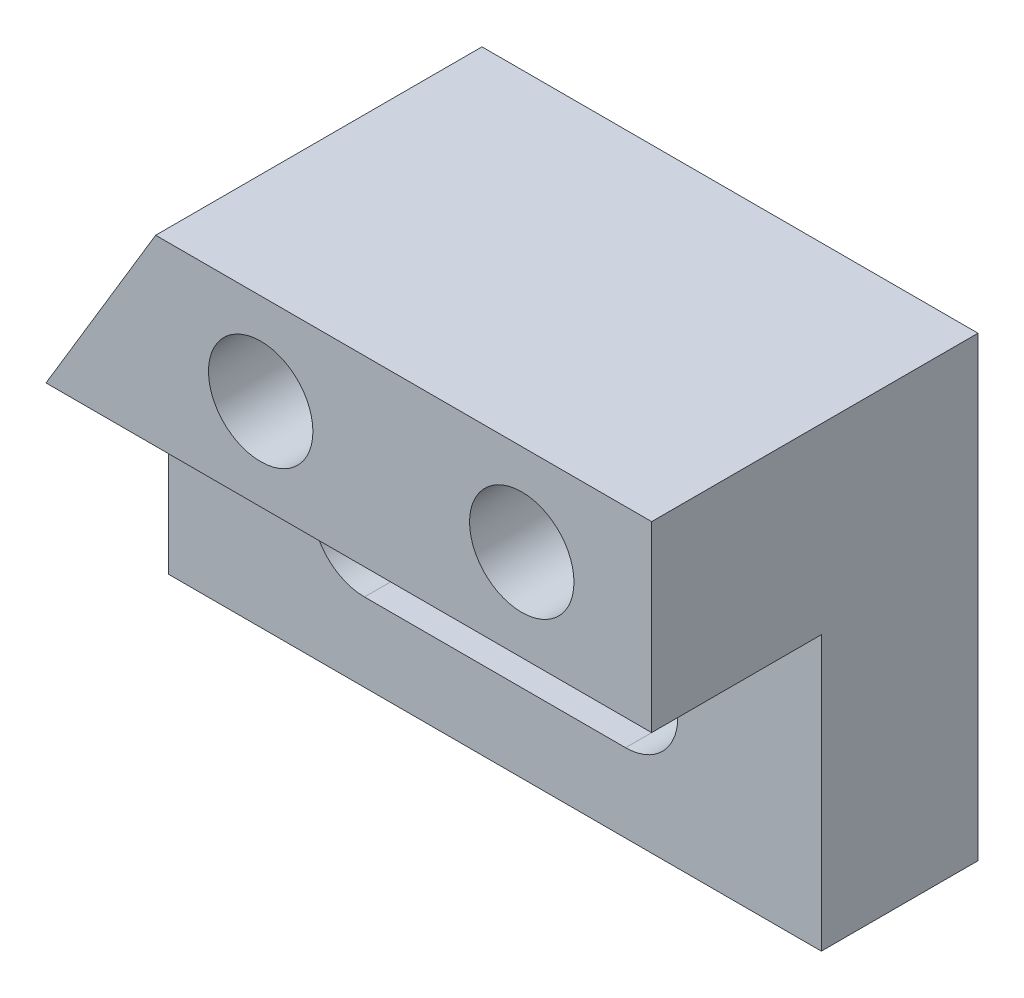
ISO-10303-21;
HEADER;
FILE_DESCRIPTION(('STEP AP214'),'2;1');
FILE_NAME('part.step','',(''),(''),'','','');
FILE_SCHEMA(('AUTOMOTIVE_DESIGN { 1 0 10303 214 1 1 1 1 }'));
ENDSEC;
DATA;
#1=APPLICATION_CONTEXT('core data for automotive mechanical design processes');
#2=APPLICATION_PROTOCOL_DEFINITION('international standard','automotive_design',2000,#1);
#3=PRODUCT_CONTEXT('',#1,'mechanical');
#4=PRODUCT('Part','Part','',(#3));
#5=PRODUCT_RELATED_PRODUCT_CATEGORY('part','',(#4));
#6=PRODUCT_DEFINITION_FORMATION('','',#4);
#7=PRODUCT_DEFINITION_CONTEXT('part definition',#1,'design');
#8=PRODUCT_DEFINITION('design','',#6,#7);
#9=PRODUCT_DEFINITION_SHAPE('','',#8);
#10=(LENGTH_UNIT() NAMED_UNIT(*) SI_UNIT(.MILLI.,.METRE.));
#11=(NAMED_UNIT(*) PLANE_ANGLE_UNIT() SI_UNIT($,.RADIAN.));
#12=(NAMED_UNIT(*) SI_UNIT($,.STERADIAN.) SOLID_ANGLE_UNIT());
#13=UNCERTAINTY_MEASURE_WITH_UNIT(LENGTH_MEASURE(1.E-05),#10,'distance_accuracy_value','');
#14=(GEOMETRIC_REPRESENTATION_CONTEXT(3) GLOBAL_UNCERTAINTY_ASSIGNED_CONTEXT((#13)) GLOBAL_UNIT_ASSIGNED_CONTEXT((#10,
#11,#12)) REPRESENTATION_CONTEXT('',''));
#15=CARTESIAN_POINT('',(0.,0.,0.));
#16=DIRECTION('',(0.,0.,1.));
#17=DIRECTION('',(1.,0.,0.));
#18=AXIS2_PLACEMENT_3D('',#15,#16,#17);
#19=CARTESIAN_POINT('',(0.,15.,12.));
#20=DIRECTION('',(1.,0.,0.));
#21=DIRECTION('',(0.,0.,-1.));
#22=AXIS2_PLACEMENT_3D('',#19,#20,#21);
#23=PLANE('',#22);
#24=DIRECTION('',(0.,-1.,0.));
#25=VECTOR('',#24,1.);
#26=CARTESIAN_POINT('',(0.,15.,0.));
#27=LINE('',#26,#25);
#28=CARTESIAN_POINT('',(0.,15.,0.));
#29=VERTEX_POINT('',#28);
#30=CARTESIAN_POINT('',(0.,0.,0.));
#31=VERTEX_POINT('',#30);
#32=EDGE_CURVE('E215',#29,#31,#27,.T.);
#33=ORIENTED_EDGE('',*,*,#32,.T.);
#34=DIRECTION('',(0.,0.,-1.));
#35=VECTOR('',#34,1.);
#36=CARTESIAN_POINT('',(0.,0.,12.));
#37=LINE('',#36,#35);
#38=CARTESIAN_POINT('',(0.,0.,12.));
#39=VERTEX_POINT('',#38);
#40=EDGE_CURVE('E11',#39,#31,#37,.T.);
#41=ORIENTED_EDGE('',*,*,#40,.F.);
#42=DIRECTION('',(0.,-1.,0.));
#43=VECTOR('',#42,1.);
#44=CARTESIAN_POINT('',(0.,15.,12.));
#45=LINE('',#44,#43);
#46=CARTESIAN_POINT('',(0.,15.,12.));
#47=VERTEX_POINT('',#46);
#48=EDGE_CURVE('E216',#47,#39,#45,.T.);
#49=ORIENTED_EDGE('',*,*,#48,.F.);
#50=DIRECTION('',(0.,0.,-1.));
#51=VECTOR('',#50,1.);
#52=CARTESIAN_POINT('',(0.,15.,12.));
#53=LINE('',#52,#51);
#54=EDGE_CURVE('E230',#47,#29,#53,.T.);
#55=ORIENTED_EDGE('',*,*,#54,.T.);
#56=EDGE_LOOP('',(#33,#41,#49,#55));
#57=FACE_BOUND('',#56,.T.);
#58=ADVANCED_FACE('F45',(#57),#23,.F.);
#59=CARTESIAN_POINT('',(0.,0.,12.));
#60=DIRECTION('',(0.,1.,0.));
#61=DIRECTION('',(0.,0.,1.));
#62=AXIS2_PLACEMENT_3D('',#59,#60,#61);
#63=PLANE('',#62);
#64=DIRECTION('',(1.,0.,0.));
#65=VECTOR('',#64,1.);
#66=CARTESIAN_POINT('',(0.,0.,0.));
#67=LINE('',#66,#65);
#68=CARTESIAN_POINT('',(50.,0.,0.));
#69=VERTEX_POINT('',#68);
#70=EDGE_CURVE('E234',#31,#69,#67,.T.);
#71=ORIENTED_EDGE('',*,*,#70,.T.);
#72=DIRECTION('',(0.,0.,-1.));
#73=VECTOR('',#72,1.);
#74=CARTESIAN_POINT('',(50.,0.,12.));
#75=LINE('',#74,#73);
#76=CARTESIAN_POINT('',(50.,0.,12.));
#77=VERTEX_POINT('',#76);
#78=EDGE_CURVE('E54',#77,#69,#75,.T.);
#79=ORIENTED_EDGE('',*,*,#78,.F.);
#80=DIRECTION('',(1.,0.,0.));
#81=VECTOR('',#80,1.);
#82=CARTESIAN_POINT('',(0.,0.,12.));
#83=LINE('',#82,#81);
#84=EDGE_CURVE('E220',#39,#77,#83,.T.);
#85=ORIENTED_EDGE('',*,*,#84,.F.);
#86=ORIENTED_EDGE('',*,*,#40,.T.);
#87=EDGE_LOOP('',(#71,#79,#85,#86));
#88=FACE_BOUND('',#87,.T.);
#89=ADVANCED_FACE('F285',(#88),#63,.F.);
#90=CARTESIAN_POINT('',(50.,35.,12.));
#91=DIRECTION('',(-1.,0.,0.));
#92=DIRECTION('',(0.,0.,1.));
#93=AXIS2_PLACEMENT_3D('',#90,#91,#92);
#94=PLANE('',#93);
#95=DIRECTION('',(0.,1.,0.));
#96=VECTOR('',#95,1.);
#97=CARTESIAN_POINT('',(50.,35.,0.));
#98=LINE('',#97,#96);
#99=CARTESIAN_POINT('',(50.,35.,0.));
#100=VERTEX_POINT('',#99);
#101=EDGE_CURVE('E238',#69,#100,#98,.T.);
#102=ORIENTED_EDGE('',*,*,#101,.T.);
#103=DIRECTION('',(0.,0.,-1.));
#104=VECTOR('',#103,1.);
#105=CARTESIAN_POINT('',(50.,35.,12.));
#106=LINE('',#105,#104);
#107=CARTESIAN_POINT('',(50.,35.,25.));
#108=VERTEX_POINT('',#107);
#109=EDGE_CURVE('E253',#108,#100,#106,.T.);
#110=ORIENTED_EDGE('',*,*,#109,.F.);
#111=DIRECTION('',(0.,-1.,0.));
#112=VECTOR('',#111,1.);
#113=CARTESIAN_POINT('',(50.,35.,25.));
#114=LINE('',#113,#112);
#115=CARTESIAN_POINT('',(50.,21.,25.));
#116=VERTEX_POINT('',#115);
#117=EDGE_CURVE('E191',#108,#116,#114,.T.);
#118=ORIENTED_EDGE('',*,*,#117,.T.);
#119=DIRECTION('',(0.,0.,-1.));
#120=VECTOR('',#119,1.);
#121=CARTESIAN_POINT('',(50.,21.,25.));
#122=LINE('',#121,#120);
#123=CARTESIAN_POINT('',(50.,21.,12.));
#124=VERTEX_POINT('',#123);
#125=EDGE_CURVE('E203',#116,#124,#122,.T.);
#126=ORIENTED_EDGE('',*,*,#125,.T.);
#127=DIRECTION('',(0.,1.,0.));
#128=VECTOR('',#127,1.);
#129=CARTESIAN_POINT('',(50.,0.,12.));
#130=LINE('',#129,#128);
#131=EDGE_CURVE('E224',#77,#124,#130,.T.);
#132=ORIENTED_EDGE('',*,*,#131,.F.);
#133=ORIENTED_EDGE('',*,*,#78,.T.);
#134=EDGE_LOOP('',(#102,#110,#118,#126,#132,#133));
#135=FACE_BOUND('',#134,.T.);
#136=ADVANCED_FACE('F290',(#135),#94,.F.);
#137=CARTESIAN_POINT('',(12.,35.,12.));
#138=DIRECTION('',(0.,-1.,0.));
#139=DIRECTION('',(0.,0.,-1.));
#140=AXIS2_PLACEMENT_3D('',#137,#138,#139);
#141=PLANE('',#140);
#142=DIRECTION('',(-1.,0.,0.));
#143=VECTOR('',#142,1.);
#144=CARTESIAN_POINT('',(12.,35.,0.));
#145=LINE('',#144,#143);
#146=CARTESIAN_POINT('',(12.,35.,0.));
#147=VERTEX_POINT('',#146);
#148=EDGE_CURVE('E241',#100,#147,#145,.T.);
#149=ORIENTED_EDGE('',*,*,#148,.T.);
#150=DIRECTION('',(0.,0.,-1.));
#151=VECTOR('',#150,1.);
#152=CARTESIAN_POINT('',(12.,35.,12.));
#153=LINE('',#152,#151);
#154=CARTESIAN_POINT('',(12.,35.,25.));
#155=VERTEX_POINT('',#154);
#156=EDGE_CURVE('E249',#155,#147,#153,.T.);
#157=ORIENTED_EDGE('',*,*,#156,.F.);
#158=DIRECTION('',(1.,0.,0.));
#159=VECTOR('',#158,1.);
#160=CARTESIAN_POINT('',(12.,35.,25.));
#161=LINE('',#160,#159);
#162=EDGE_CURVE('E187',#155,#108,#161,.T.);
#163=ORIENTED_EDGE('',*,*,#162,.T.);
#164=ORIENTED_EDGE('',*,*,#109,.T.);
#165=EDGE_LOOP('',(#149,#157,#163,#164));
#166=FACE_BOUND('',#165,.T.);
#167=ADVANCED_FACE('F309',(#166),#141,.F.);
#168=CARTESIAN_POINT('',(12.,35.,12.));
#169=DIRECTION('',(0.857492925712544,-0.514495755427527,0.));
#170=DIRECTION('',(0.514495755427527,0.857492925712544,0.));
#171=AXIS2_PLACEMENT_3D('',#168,#169,#170);
#172=PLANE('',#171);
#173=DIRECTION('',(-0.514495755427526,-0.857492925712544,0.));
#174=VECTOR('',#173,1.);
#175=CARTESIAN_POINT('',(12.,35.,12.));
#176=LINE('',#175,#174);
#177=CARTESIAN_POINT('',(3.6,21.,12.));
#178=VERTEX_POINT('',#177);
#179=EDGE_CURVE('E227',#178,#47,#176,.T.);
#180=ORIENTED_EDGE('',*,*,#179,.F.);
#181=DIRECTION('',(0.,0.,-1.));
#182=VECTOR('',#181,1.);
#183=CARTESIAN_POINT('',(3.6,21.,25.));
#184=LINE('',#183,#182);
#185=CARTESIAN_POINT('',(3.6,21.,25.));
#186=VERTEX_POINT('',#185);
#187=EDGE_CURVE('E204',#186,#178,#184,.T.);
#188=ORIENTED_EDGE('',*,*,#187,.F.);
#189=DIRECTION('',(0.514495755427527,0.857492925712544,0.));
#190=VECTOR('',#189,1.);
#191=CARTESIAN_POINT('',(3.6,21.,25.));
#192=LINE('',#191,#190);
#193=EDGE_CURVE('E199',#186,#155,#192,.T.);
#194=ORIENTED_EDGE('',*,*,#193,.T.);
#195=ORIENTED_EDGE('',*,*,#156,.T.);
#196=DIRECTION('',(-0.514495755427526,-0.857492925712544,0.));
#197=VECTOR('',#196,1.);
#198=CARTESIAN_POINT('',(12.,35.,0.));
#199=LINE('',#198,#197);
#200=EDGE_CURVE('E221',#147,#29,#199,.T.);
#201=ORIENTED_EDGE('',*,*,#200,.T.);
#202=ORIENTED_EDGE('',*,*,#54,.F.);
#203=EDGE_LOOP('',(#180,#188,#194,#195,#201,#202));
#204=FACE_BOUND('',#203,.T.);
#205=ADVANCED_FACE('F305',(#204),#172,.F.);
#206=CARTESIAN_POINT('',(0.,0.,12.));
#207=DIRECTION('',(0.,0.,1.));
#208=DIRECTION('',(1.,0.,0.));
#209=AXIS2_PLACEMENT_3D('',#206,#207,#208);
#210=PLANE('',#209);
#211=CARTESIAN_POINT('',(35.,10.,12.));
#212=DIRECTION('',(0.,0.,1.));
#213=DIRECTION('',(1.,0.,0.));
#214=AXIS2_PLACEMENT_3D('',#211,#212,#213);
#215=CIRCLE('',#214,4.);
#216=CARTESIAN_POINT('',(35.,6.,12.));
#217=VERTEX_POINT('',#216);
#218=CARTESIAN_POINT('',(35.,14.,12.));
#219=VERTEX_POINT('',#218);
#220=EDGE_CURVE('E62',#217,#219,#215,.T.);
#221=ORIENTED_EDGE('',*,*,#220,.F.);
#222=DIRECTION('',(1.,0.,0.));
#223=VECTOR('',#222,1.);
#224=CARTESIAN_POINT('',(35.,6.,12.));
#225=LINE('',#224,#223);
#226=CARTESIAN_POINT('',(15.,5.99999999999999,12.));
#227=VERTEX_POINT('',#226);
#228=EDGE_CURVE('E151',#227,#217,#225,.T.);
#229=ORIENTED_EDGE('',*,*,#228,.F.);
#230=CARTESIAN_POINT('',(15.,10.,12.));
#231=DIRECTION('',(0.,0.,1.));
#232=DIRECTION('',(-1.,0.,0.));
#233=AXIS2_PLACEMENT_3D('',#230,#231,#232);
#234=CIRCLE('',#233,4.);
#235=CARTESIAN_POINT('',(15.,14.,12.));
#236=VERTEX_POINT('',#235);
#237=EDGE_CURVE('E155',#236,#227,#234,.T.);
#238=ORIENTED_EDGE('',*,*,#237,.F.);
#239=DIRECTION('',(-1.,0.,0.));
#240=VECTOR('',#239,1.);
#241=CARTESIAN_POINT('',(15.,14.,12.));
#242=LINE('',#241,#240);
#243=EDGE_CURVE('E164',#219,#236,#242,.T.);
#244=ORIENTED_EDGE('',*,*,#243,.F.);
#245=EDGE_LOOP('',(#221,#229,#238,#244));
#246=FACE_BOUND('',#245,.T.);
#247=DIRECTION('',(1.,0.,0.));
#248=VECTOR('',#247,1.);
#249=CARTESIAN_POINT('',(0.,21.,12.));
#250=LINE('',#249,#248);
#251=EDGE_CURVE('E208',#178,#124,#250,.T.);
#252=ORIENTED_EDGE('',*,*,#251,.F.);
#253=ORIENTED_EDGE('',*,*,#179,.T.);
#254=ORIENTED_EDGE('',*,*,#48,.T.);
#255=ORIENTED_EDGE('',*,*,#84,.T.);
#256=ORIENTED_EDGE('',*,*,#131,.T.);
#257=EDGE_LOOP('',(#252,#253,#254,#255,#256));
#258=FACE_BOUND('',#257,.T.);
#259=ADVANCED_FACE('F302',(#246,#258),#210,.T.);
#260=CARTESIAN_POINT('',(0.,0.,0.));
#261=DIRECTION('',(0.,0.,1.));
#262=DIRECTION('',(1.,0.,0.));
#263=AXIS2_PLACEMENT_3D('',#260,#261,#262);
#264=PLANE('',#263);
#265=DIRECTION('',(1.,0.,0.));
#266=VECTOR('',#265,1.);
#267=CARTESIAN_POINT('',(35.,6.,0.));
#268=LINE('',#267,#266);
#269=CARTESIAN_POINT('',(15.,5.99999999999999,0.));
#270=VERTEX_POINT('',#269);
#271=CARTESIAN_POINT('',(35.,6.,0.));
#272=VERTEX_POINT('',#271);
#273=EDGE_CURVE('E139',#270,#272,#268,.T.);
#274=ORIENTED_EDGE('',*,*,#273,.T.);
#275=CARTESIAN_POINT('',(35.,10.,0.));
#276=DIRECTION('',(0.,0.,1.));
#277=DIRECTION('',(1.,0.,0.));
#278=AXIS2_PLACEMENT_3D('',#275,#276,#277);
#279=CIRCLE('',#278,4.);
#280=CARTESIAN_POINT('',(35.,14.,0.));
#281=VERTEX_POINT('',#280);
#282=EDGE_CURVE('E132',#272,#281,#279,.T.);
#283=ORIENTED_EDGE('',*,*,#282,.T.);
#284=DIRECTION('',(-1.,0.,0.));
#285=VECTOR('',#284,1.);
#286=CARTESIAN_POINT('',(15.,14.,0.));
#287=LINE('',#286,#285);
#288=CARTESIAN_POINT('',(15.,14.,0.));
#289=VERTEX_POINT('',#288);
#290=EDGE_CURVE('E142',#281,#289,#287,.T.);
#291=ORIENTED_EDGE('',*,*,#290,.T.);
#292=CARTESIAN_POINT('',(15.,10.,0.));
#293=DIRECTION('',(0.,0.,1.));
#294=DIRECTION('',(-1.,0.,0.));
#295=AXIS2_PLACEMENT_3D('',#292,#293,#294);
#296=CIRCLE('',#295,4.);
#297=EDGE_CURVE('E70',#289,#270,#296,.T.);
#298=ORIENTED_EDGE('',*,*,#297,.T.);
#299=EDGE_LOOP('',(#274,#283,#291,#298));
#300=FACE_BOUND('',#299,.T.);
#301=CARTESIAN_POINT('',(20.0469106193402,28.,0.));
#302=DIRECTION('',(0.,0.,1.));
#303=DIRECTION('',(1.,0.,0.));
#304=AXIS2_PLACEMENT_3D('',#301,#302,#303);
#305=CIRCLE('',#304,4.);
#306=CARTESIAN_POINT('',(24.0469106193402,28.,0.));
#307=VERTEX_POINT('',#306);
#308=EDGE_CURVE('E179',#307,#307,#305,.T.);
#309=ORIENTED_EDGE('',*,*,#308,.T.);
#310=EDGE_LOOP('',(#309));
#311=FACE_BOUND('',#310,.T.);
#312=CARTESIAN_POINT('',(40.0469106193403,28.,0.));
#313=DIRECTION('',(0.,0.,1.));
#314=DIRECTION('',(1.,0.,0.));
#315=AXIS2_PLACEMENT_3D('',#312,#313,#314);
#316=CIRCLE('',#315,4.);
#317=CARTESIAN_POINT('',(44.0469106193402,28.,0.));
#318=VERTEX_POINT('',#317);
#319=EDGE_CURVE('E173',#318,#318,#316,.T.);
#320=ORIENTED_EDGE('',*,*,#319,.T.);
#321=EDGE_LOOP('',(#320));
#322=FACE_BOUND('',#321,.T.);
#323=ORIENTED_EDGE('',*,*,#32,.F.);
#324=ORIENTED_EDGE('',*,*,#200,.F.);
#325=ORIENTED_EDGE('',*,*,#148,.F.);
#326=ORIENTED_EDGE('',*,*,#101,.F.);
#327=ORIENTED_EDGE('',*,*,#70,.F.);
#328=EDGE_LOOP('',(#323,#324,#325,#326,#327));
#329=FACE_BOUND('',#328,.T.);
#330=ADVANCED_FACE('F147',(#300,#311,#322,#329),#264,.F.);
#331=CARTESIAN_POINT('',(50.,21.,25.));
#332=DIRECTION('',(0.,-1.,0.));
#333=DIRECTION('',(0.,0.,-1.));
#334=AXIS2_PLACEMENT_3D('',#331,#332,#333);
#335=PLANE('',#334);
#336=ORIENTED_EDGE('',*,*,#187,.T.);
#337=ORIENTED_EDGE('',*,*,#251,.T.);
#338=ORIENTED_EDGE('',*,*,#125,.F.);
#339=DIRECTION('',(-1.,0.,0.));
#340=VECTOR('',#339,1.);
#341=CARTESIAN_POINT('',(50.,21.,25.));
#342=LINE('',#341,#340);
#343=EDGE_CURVE('E195',#116,#186,#342,.T.);
#344=ORIENTED_EDGE('',*,*,#343,.T.);
#345=EDGE_LOOP('',(#336,#337,#338,#344));
#346=FACE_BOUND('',#345,.T.);
#347=ADVANCED_FACE('F315',(#346),#335,.T.);
#348=CARTESIAN_POINT('',(0.,0.,25.));
#349=DIRECTION('',(0.,0.,-1.));
#350=DIRECTION('',(-1.,0.,0.));
#351=AXIS2_PLACEMENT_3D('',#348,#349,#350);
#352=PLANE('',#351);
#353=CARTESIAN_POINT('',(20.0469106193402,28.,25.));
#354=DIRECTION('',(0.,0.,-1.));
#355=DIRECTION('',(-1.,0.,0.));
#356=AXIS2_PLACEMENT_3D('',#353,#354,#355);
#357=CIRCLE('',#356,4.);
#358=CARTESIAN_POINT('',(16.0469106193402,28.,25.));
#359=VERTEX_POINT('',#358);
#360=EDGE_CURVE('E48',#359,#359,#357,.T.);
#361=ORIENTED_EDGE('',*,*,#360,.T.);
#362=EDGE_LOOP('',(#361));
#363=FACE_BOUND('',#362,.T.);
#364=CARTESIAN_POINT('',(40.0469106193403,28.,25.));
#365=DIRECTION('',(0.,0.,-1.));
#366=DIRECTION('',(-1.,0.,0.));
#367=AXIS2_PLACEMENT_3D('',#364,#365,#366);
#368=CIRCLE('',#367,4.);
#369=CARTESIAN_POINT('',(36.0469106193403,28.,25.));
#370=VERTEX_POINT('',#369);
#371=EDGE_CURVE('E183',#370,#370,#368,.T.);
#372=ORIENTED_EDGE('',*,*,#371,.T.);
#373=EDGE_LOOP('',(#372));
#374=FACE_BOUND('',#373,.T.);
#375=ORIENTED_EDGE('',*,*,#162,.F.);
#376=ORIENTED_EDGE('',*,*,#193,.F.);
#377=ORIENTED_EDGE('',*,*,#343,.F.);
#378=ORIENTED_EDGE('',*,*,#117,.F.);
#379=EDGE_LOOP('',(#375,#376,#377,#378));
#380=FACE_BOUND('',#379,.T.);
#381=ADVANCED_FACE('F267',(#363,#374,#380),#352,.F.);
#382=CARTESIAN_POINT('',(40.0469106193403,28.,0.));
#383=DIRECTION('',(0.,0.,1.));
#384=DIRECTION('',(1.,0.,0.));
#385=AXIS2_PLACEMENT_3D('',#382,#383,#384);
#386=CYLINDRICAL_SURFACE('',#385,4.);
#387=ORIENTED_EDGE('',*,*,#319,.F.);
#388=EDGE_LOOP('',(#387));
#389=FACE_BOUND('',#388,.T.);
#390=ORIENTED_EDGE('',*,*,#371,.F.);
#391=EDGE_LOOP('',(#390));
#392=FACE_BOUND('',#391,.T.);
#393=ADVANCED_FACE('F271',(#389,#392),#386,.F.);
#394=CARTESIAN_POINT('',(20.0469106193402,28.,0.));
#395=DIRECTION('',(0.,0.,1.));
#396=DIRECTION('',(1.,0.,0.));
#397=AXIS2_PLACEMENT_3D('',#394,#395,#396);
#398=CYLINDRICAL_SURFACE('',#397,4.);
#399=ORIENTED_EDGE('',*,*,#308,.F.);
#400=EDGE_LOOP('',(#399));
#401=FACE_BOUND('',#400,.T.);
#402=ORIENTED_EDGE('',*,*,#360,.F.);
#403=EDGE_LOOP('',(#402));
#404=FACE_BOUND('',#403,.T.);
#405=ADVANCED_FACE('F269',(#401,#404),#398,.F.);
#406=CARTESIAN_POINT('',(35.,10.,0.));
#407=DIRECTION('',(0.,0.,1.));
#408=DIRECTION('',(1.,0.,0.));
#409=AXIS2_PLACEMENT_3D('',#406,#407,#408);
#410=CYLINDRICAL_SURFACE('',#409,4.);
#411=ORIENTED_EDGE('',*,*,#220,.T.);
#412=DIRECTION('',(0.,0.,1.));
#413=VECTOR('',#412,1.);
#414=CARTESIAN_POINT('',(35.,14.,0.));
#415=LINE('',#414,#413);
#416=EDGE_CURVE('E128',#281,#219,#415,.T.);
#417=ORIENTED_EDGE('',*,*,#416,.F.);
#418=ORIENTED_EDGE('',*,*,#282,.F.);
#419=DIRECTION('',(0.,0.,1.));
#420=VECTOR('',#419,1.);
#421=CARTESIAN_POINT('',(35.,6.,0.));
#422=LINE('',#421,#420);
#423=EDGE_CURVE('E170',#272,#217,#422,.T.);
#424=ORIENTED_EDGE('',*,*,#423,.T.);
#425=EDGE_LOOP('',(#411,#417,#418,#424));
#426=FACE_BOUND('',#425,.T.);
#427=ADVANCED_FACE('F130',(#426),#410,.F.);
#428=CARTESIAN_POINT('',(35.,6.,0.));
#429=DIRECTION('',(0.,-1.,0.));
#430=DIRECTION('',(1.,0.,0.));
#431=AXIS2_PLACEMENT_3D('',#428,#429,#430);
#432=PLANE('',#431);
#433=ORIENTED_EDGE('',*,*,#228,.T.);
#434=ORIENTED_EDGE('',*,*,#423,.F.);
#435=ORIENTED_EDGE('',*,*,#273,.F.);
#436=DIRECTION('',(0.,0.,1.));
#437=VECTOR('',#436,1.);
#438=CARTESIAN_POINT('',(15.,5.99999999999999,0.));
#439=LINE('',#438,#437);
#440=EDGE_CURVE('E174',#270,#227,#439,.T.);
#441=ORIENTED_EDGE('',*,*,#440,.T.);
#442=EDGE_LOOP('',(#433,#434,#435,#441));
#443=FACE_BOUND('',#442,.T.);
#444=ADVANCED_FACE('F279',(#443),#432,.F.);
#445=CARTESIAN_POINT('',(15.,10.,0.));
#446=DIRECTION('',(0.,0.,1.));
#447=DIRECTION('',(1.,0.,0.));
#448=AXIS2_PLACEMENT_3D('',#445,#446,#447);
#449=CYLINDRICAL_SURFACE('',#448,4.);
#450=ORIENTED_EDGE('',*,*,#237,.T.);
#451=ORIENTED_EDGE('',*,*,#440,.F.);
#452=ORIENTED_EDGE('',*,*,#297,.F.);
#453=DIRECTION('',(0.,0.,1.));
#454=VECTOR('',#453,1.);
#455=CARTESIAN_POINT('',(15.,14.,0.));
#456=LINE('',#455,#454);
#457=EDGE_CURVE('E138',#289,#236,#456,.T.);
#458=ORIENTED_EDGE('',*,*,#457,.T.);
#459=EDGE_LOOP('',(#450,#451,#452,#458));
#460=FACE_BOUND('',#459,.T.);
#461=ADVANCED_FACE('F387',(#460),#449,.F.);
#462=CARTESIAN_POINT('',(15.,14.,0.));
#463=DIRECTION('',(0.,1.,0.));
#464=DIRECTION('',(-1.,0.,0.));
#465=AXIS2_PLACEMENT_3D('',#462,#463,#464);
#466=PLANE('',#465);
#467=ORIENTED_EDGE('',*,*,#243,.T.);
#468=ORIENTED_EDGE('',*,*,#457,.F.);
#469=ORIENTED_EDGE('',*,*,#290,.F.);
#470=ORIENTED_EDGE('',*,*,#416,.T.);
#471=EDGE_LOOP('',(#467,#468,#469,#470));
#472=FACE_BOUND('',#471,.T.);
#473=ADVANCED_FACE('F143',(#472),#466,.F.);
#474=CLOSED_SHELL('',(#58,#89,#136,#167,#205,#259,#330,#347,#381,#393,#405,#427,#444,#461,#473));
#475=MANIFOLD_SOLID_BREP('B2',#474);
#476=ADVANCED_BREP_SHAPE_REPRESENTATION('',(#18,#475),#14);
#477=SHAPE_DEFINITION_REPRESENTATION(#9,#476);
ENDSEC;
END-ISO-10303-21;
